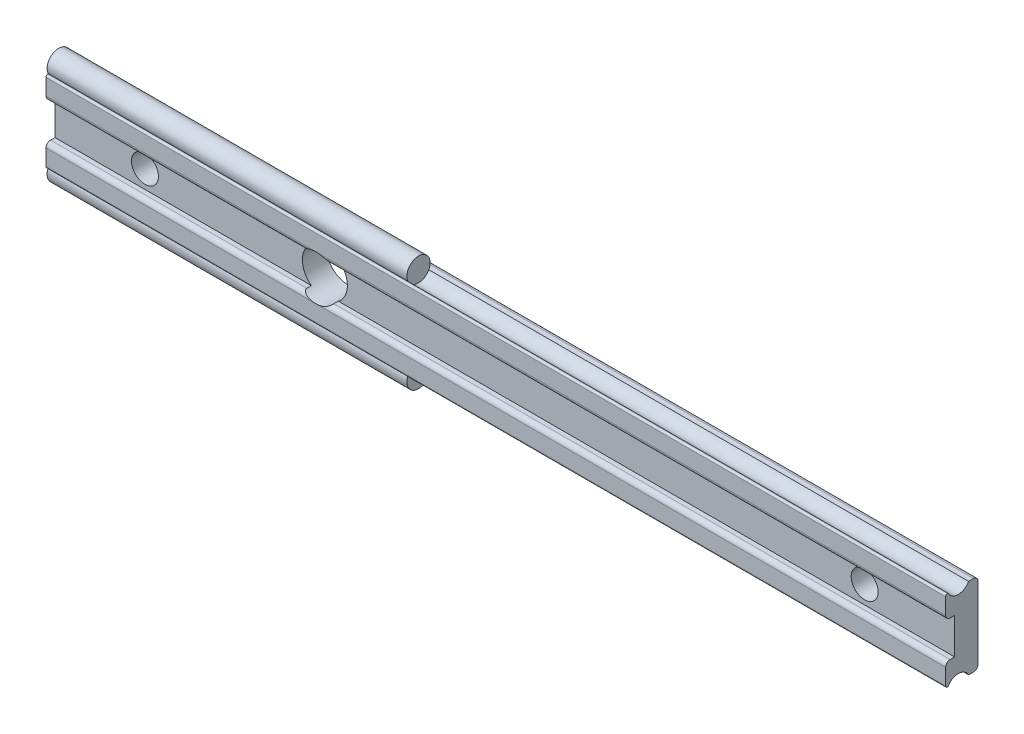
ISO-10303-21;
HEADER;
FILE_DESCRIPTION(('STEP AP214'),'2;1');
FILE_NAME('part.step','',(''),(''),'','','');
FILE_SCHEMA(('AUTOMOTIVE_DESIGN { 1 0 10303 214 1 1 1 1 }'));
ENDSEC;
DATA;
#1=APPLICATION_CONTEXT('core data for automotive mechanical design processes');
#2=APPLICATION_PROTOCOL_DEFINITION('international standard','automotive_design',2000,#1);
#3=PRODUCT_CONTEXT('',#1,'mechanical');
#4=PRODUCT('Part','Part','',(#3));
#5=PRODUCT_RELATED_PRODUCT_CATEGORY('part','',(#4));
#6=PRODUCT_DEFINITION_FORMATION('','',#4);
#7=PRODUCT_DEFINITION_CONTEXT('part definition',#1,'design');
#8=PRODUCT_DEFINITION('design','',#6,#7);
#9=PRODUCT_DEFINITION_SHAPE('','',#8);
#10=(LENGTH_UNIT() NAMED_UNIT(*) SI_UNIT(.MILLI.,.METRE.));
#11=(NAMED_UNIT(*) PLANE_ANGLE_UNIT() SI_UNIT($,.RADIAN.));
#12=(NAMED_UNIT(*) SI_UNIT($,.STERADIAN.) SOLID_ANGLE_UNIT());
#13=UNCERTAINTY_MEASURE_WITH_UNIT(LENGTH_MEASURE(1.E-05),#10,'distance_accuracy_value','');
#14=(GEOMETRIC_REPRESENTATION_CONTEXT(3) GLOBAL_UNCERTAINTY_ASSIGNED_CONTEXT((#13)) GLOBAL_UNIT_ASSIGNED_CONTEXT((#10,
#11,#12)) REPRESENTATION_CONTEXT('',''));
#15=CARTESIAN_POINT('',(0.,0.,0.));
#16=DIRECTION('',(0.,0.,1.));
#17=DIRECTION('',(1.,0.,0.));
#18=AXIS2_PLACEMENT_3D('',#15,#16,#17);
#19=CARTESIAN_POINT('',(-10.,-5.10000002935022,2.18999997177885));
#20=DIRECTION('',(1.,0.,0.));
#21=DIRECTION('',(0.,0.,-1.));
#22=AXIS2_PLACEMENT_3D('',#19,#20,#21);
#23=CYLINDRICAL_SURFACE('',#22,1.28999999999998);
#24=DIRECTION('',(1.,0.,0.));
#25=VECTOR('',#24,1.);
#26=CARTESIAN_POINT('',(-10.,-4.50000002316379,3.33197194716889));
#27=LINE('',#26,#25);
#28=CARTESIAN_POINT('',(30.,-4.50000002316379,3.33197194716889));
#29=VERTEX_POINT('',#28);
#30=CARTESIAN_POINT('',(90.,-4.50000002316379,3.33197194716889));
#31=VERTEX_POINT('',#30);
#32=EDGE_CURVE('E36',#29,#31,#27,.T.);
#33=ORIENTED_EDGE('',*,*,#32,.F.);
#34=CARTESIAN_POINT('',(30.,-5.10000002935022,2.18999997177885));
#35=DIRECTION('',(-1.,0.,0.));
#36=DIRECTION('',(0.,0.,1.));
#37=AXIS2_PLACEMENT_3D('',#34,#35,#36);
#38=CIRCLE('',#37,1.28999999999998);
#39=CARTESIAN_POINT('',(30.,-4.50000002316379,1.04802799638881));
#40=VERTEX_POINT('',#39);
#41=EDGE_CURVE('E31',#29,#40,#38,.T.);
#42=ORIENTED_EDGE('',*,*,#41,.T.);
#43=DIRECTION('',(1.,0.,0.));
#44=VECTOR('',#43,1.);
#45=CARTESIAN_POINT('',(-10.,-4.50000002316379,1.04802799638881));
#46=LINE('',#45,#44);
#47=CARTESIAN_POINT('',(90.,-4.50000002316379,1.04802799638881));
#48=VERTEX_POINT('',#47);
#49=EDGE_CURVE('E199',#40,#48,#46,.T.);
#50=ORIENTED_EDGE('',*,*,#49,.T.);
#51=CARTESIAN_POINT('',(90.,-5.10000002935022,2.18999997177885));
#52=DIRECTION('',(-1.,0.,0.));
#53=DIRECTION('',(0.,0.,1.));
#54=AXIS2_PLACEMENT_3D('',#51,#52,#53);
#55=CIRCLE('',#54,1.28999999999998);
#56=EDGE_CURVE('E343',#31,#48,#55,.T.);
#57=ORIENTED_EDGE('',*,*,#56,.F.);
#58=EDGE_LOOP('',(#33,#42,#50,#57));
#59=FACE_BOUND('',#58,.T.);
#60=ADVANCED_FACE('F14',(#59),#23,.F.);
#61=CARTESIAN_POINT('',(-10.,5.10000002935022,2.18999997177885));
#62=DIRECTION('',(1.,0.,0.));
#63=DIRECTION('',(0.,0.,-1.));
#64=AXIS2_PLACEMENT_3D('',#61,#62,#63);
#65=CYLINDRICAL_SURFACE('',#64,1.28999999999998);
#66=DIRECTION('',(1.,0.,0.));
#67=VECTOR('',#66,1.);
#68=CARTESIAN_POINT('',(-10.,4.50000002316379,1.04802799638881));
#69=LINE('',#68,#67);
#70=CARTESIAN_POINT('',(30.,4.50000002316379,1.04802799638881));
#71=VERTEX_POINT('',#70);
#72=CARTESIAN_POINT('',(90.,4.50000002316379,1.04802799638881));
#73=VERTEX_POINT('',#72);
#74=EDGE_CURVE('E434',#71,#73,#69,.T.);
#75=ORIENTED_EDGE('',*,*,#74,.F.);
#76=CARTESIAN_POINT('',(30.,5.10000002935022,2.18999997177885));
#77=DIRECTION('',(-1.,0.,0.));
#78=DIRECTION('',(0.,0.,1.));
#79=AXIS2_PLACEMENT_3D('',#76,#77,#78);
#80=CIRCLE('',#79,1.28999999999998);
#81=CARTESIAN_POINT('',(30.,4.50000002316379,3.33197194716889));
#82=VERTEX_POINT('',#81);
#83=EDGE_CURVE('E215',#71,#82,#80,.T.);
#84=ORIENTED_EDGE('',*,*,#83,.T.);
#85=DIRECTION('',(1.,0.,0.));
#86=VECTOR('',#85,1.);
#87=CARTESIAN_POINT('',(-10.,4.50000002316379,3.33197194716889));
#88=LINE('',#87,#86);
#89=CARTESIAN_POINT('',(90.,4.50000002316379,3.33197194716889));
#90=VERTEX_POINT('',#89);
#91=EDGE_CURVE('E431',#82,#90,#88,.T.);
#92=ORIENTED_EDGE('',*,*,#91,.T.);
#93=CARTESIAN_POINT('',(90.,5.10000002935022,2.18999997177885));
#94=DIRECTION('',(-1.,0.,0.));
#95=DIRECTION('',(0.,0.,-1.));
#96=AXIS2_PLACEMENT_3D('',#93,#94,#95);
#97=CIRCLE('',#96,1.28999999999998);
#98=EDGE_CURVE('E446',#73,#90,#97,.T.);
#99=ORIENTED_EDGE('',*,*,#98,.F.);
#100=EDGE_LOOP('',(#75,#84,#92,#99));
#101=FACE_BOUND('',#100,.T.);
#102=ADVANCED_FACE('F296',(#101),#65,.F.);
#103=CARTESIAN_POINT('',(-10.,-2.50000002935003,3.0999999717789));
#104=DIRECTION('',(1.,0.,0.));
#105=DIRECTION('',(0.,0.,-1.));
#106=AXIS2_PLACEMENT_3D('',#103,#104,#105);
#107=CYLINDRICAL_SURFACE('',#106,0.5);
#108=CARTESIAN_POINT('',(18.5000000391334,-2.00000002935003,3.0999999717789));
#109=CARTESIAN_POINT('',(18.4999623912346,-1.99996207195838,3.11987287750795));
#110=CARTESIAN_POINT('',(18.5015761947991,-2.00118249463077,3.13968780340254));
#111=CARTESIAN_POINT('',(18.5077735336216,-2.00581273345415,3.17838692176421));
#112=CARTESIAN_POINT('',(18.5123272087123,-2.00920053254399,3.19727844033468));
#113=CARTESIAN_POINT('',(18.524064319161,-2.01783620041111,3.23368112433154));
#114=CARTESIAN_POINT('',(18.5312395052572,-2.02307823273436,3.25119641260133));
#115=CARTESIAN_POINT('',(18.5478060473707,-2.03500322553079,3.28464478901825));
#116=CARTESIAN_POINT('',(18.5572029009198,-2.04168975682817,3.30057381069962));
#117=CARTESIAN_POINT('',(18.5821801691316,-2.05915126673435,3.33710629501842));
#118=CARTESIAN_POINT('',(18.5986909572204,-2.07045578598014,3.35681757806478));
#119=CARTESIAN_POINT('',(18.6343735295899,-2.09416519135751,3.39285662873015));
#120=CARTESIAN_POINT('',(18.6535504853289,-2.10657219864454,3.40917766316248));
#121=CARTESIAN_POINT('',(18.7057779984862,-2.13925431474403,3.44760067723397));
#122=CARTESIAN_POINT('',(18.7403171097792,-2.15983620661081,3.46739923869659));
#123=CARTESIAN_POINT('',(18.8124646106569,-2.20033841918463,3.50112098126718));
#124=CARTESIAN_POINT('',(18.850079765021,-2.22025713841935,3.51503077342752));
#125=CARTESIAN_POINT('',(18.9246423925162,-2.25725862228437,3.53761969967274));
#126=CARTESIAN_POINT('',(18.9614526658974,-2.27444229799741,3.54659655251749));
#127=CARTESIAN_POINT('',(19.0363776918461,-2.30718587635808,3.56167921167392));
#128=CARTESIAN_POINT('',(19.0744935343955,-2.32274437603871,3.56778255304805));
#129=CARTESIAN_POINT('',(19.1517657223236,-2.35206511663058,3.57786589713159));
#130=CARTESIAN_POINT('',(19.1909240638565,-2.36582356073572,3.5818414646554));
#131=CARTESIAN_POINT('',(19.2699963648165,-2.39140610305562,3.58824225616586));
#132=CARTESIAN_POINT('',(19.3099105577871,-2.40322959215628,3.59066699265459));
#133=CARTESIAN_POINT('',(19.4163047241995,-2.43187057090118,3.59567017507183));
#134=CARTESIAN_POINT('',(19.4832923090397,-2.44698126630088,3.59733638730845));
#135=CARTESIAN_POINT('',(19.6183198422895,-2.47164651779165,3.59934733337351));
#136=CARTESIAN_POINT('',(19.6863603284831,-2.48119813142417,3.59969136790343));
#137=CARTESIAN_POINT('',(19.8231051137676,-2.49468127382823,3.60001763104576));
#138=CARTESIAN_POINT('',(19.8918102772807,-2.49860408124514,3.59999929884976));
#139=CARTESIAN_POINT('',(20.0292885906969,-2.50077334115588,3.60000045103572));
#140=CARTESIAN_POINT('',(20.0980617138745,-2.49902150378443,3.60001992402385));
#141=CARTESIAN_POINT('',(20.2361894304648,-2.48979369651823,3.59991747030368));
#142=CARTESIAN_POINT('',(20.3055387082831,-2.48223803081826,3.59979356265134));
#143=CARTESIAN_POINT('',(20.4434132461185,-2.46135084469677,3.59861400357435));
#144=CARTESIAN_POINT('',(20.5119378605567,-2.44801506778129,3.5975576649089));
#145=CARTESIAN_POINT('',(20.647193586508,-2.41577094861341,3.59312171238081));
#146=CARTESIAN_POINT('',(20.7139325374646,-2.396893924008,3.5897550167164));
#147=CARTESIAN_POINT('',(20.8452354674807,-2.35378973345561,3.57866700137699));
#148=CARTESIAN_POINT('',(20.9098033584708,-2.32957285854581,3.57095401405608));
#149=CARTESIAN_POINT('',(21.0068972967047,-2.28856748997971,3.5533641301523));
#150=CARTESIAN_POINT('',(21.0405930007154,-2.27343563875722,3.54608306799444));
#151=CARTESIAN_POINT('',(21.1067254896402,-2.24198497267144,3.52866413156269));
#152=CARTESIAN_POINT('',(21.1391613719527,-2.2256653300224,3.51852425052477));
#153=CARTESIAN_POINT('',(21.2024883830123,-2.19210294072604,3.49449855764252));
#154=CARTESIAN_POINT('',(21.233366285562,-2.17485425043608,3.48058554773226));
#155=CARTESIAN_POINT('',(21.2924927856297,-2.14023972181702,3.44804575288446));
#156=CARTESIAN_POINT('',(21.3207460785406,-2.12287415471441,3.42942761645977));
#157=CARTESIAN_POINT('',(21.3636912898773,-2.09540988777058,3.39428778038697));
#158=CARTESIAN_POINT('',(21.3795669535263,-2.08497392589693,3.37948471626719));
#159=CARTESIAN_POINT('',(21.4092206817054,-2.0650457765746,3.3473296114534));
#160=CARTESIAN_POINT('',(21.4230004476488,-2.05555282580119,3.32997966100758));
#161=CARTESIAN_POINT('',(21.4458455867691,-2.03953296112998,3.29562678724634));
#162=CARTESIAN_POINT('',(21.4553118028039,-2.03277439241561,3.27900168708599));
#163=CARTESIAN_POINT('',(21.4718168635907,-2.02085580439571,3.24408352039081));
#164=CARTESIAN_POINT('',(21.4788617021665,-2.01569184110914,3.22579471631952));
#165=CARTESIAN_POINT('',(21.4895121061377,-2.00783357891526,3.18984795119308));
#166=CARTESIAN_POINT('',(21.4933960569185,-2.00494048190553,3.17231727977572));
#167=CARTESIAN_POINT('',(21.4986638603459,-2.00100227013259,3.13654134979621));
#168=CARTESIAN_POINT('',(21.5000272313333,-1.9999722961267,3.11829145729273));
#169=CARTESIAN_POINT('',(21.4999999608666,-2.00000002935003,3.0999999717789));
#170=B_SPLINE_CURVE_WITH_KNOTS('',3,(#108,#109,#110,#111,#112,#113,#114,#115,#116,#117,#118,
#119,#120,#121,#122,#123,#124,#125,#126,#127,#128,#129,#130,#131,#132,#133,#134,#135,#136,#137,
#138,#139,#140,#141,#142,#143,#144,#145,#146,#147,#148,#149,#150,#151,#152,#153,#154,#155,#156,
#157,#158,#159,#160,#161,#162,#163,#164,#165,#166,#167,#168,#169),.UNSPECIFIED.,.F.,.F.,(4,2,2,
2,2,2,2,2,2,2,2,2,2,2,2,2,2,2,2,2,2,2,2,2,2,2,2,2,2,2,4),(0.,0.0594240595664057,
0.11825384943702,0.176900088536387,0.235692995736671,0.319483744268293,0.403439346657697,
0.537132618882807,0.671128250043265,0.795755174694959,0.920488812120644,1.04548144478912,
1.17051334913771,1.37630111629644,1.58219770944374,1.78841297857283,1.99456610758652,
2.20360179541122,2.41279168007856,2.62082132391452,2.82845350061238,2.94128618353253,
3.05419826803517,3.16794695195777,3.28148805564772,3.35355275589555,3.42555863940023,
3.48619419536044,3.54667855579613,3.6009670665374,3.65569480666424),.UNSPECIFIED.);
#171=CARTESIAN_POINT('',(18.5000000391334,-2.00000002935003,3.0999999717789));
#172=VERTEX_POINT('',#171);
#173=CARTESIAN_POINT('',(20.,-2.50000002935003,3.5999999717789));
#174=VERTEX_POINT('',#173);
#175=EDGE_CURVE('E258',#172,#174,#170,.T.);
#176=ORIENTED_EDGE('',*,*,#175,.F.);
#177=DIRECTION('',(1.,0.,0.));
#178=VECTOR('',#177,1.);
#179=CARTESIAN_POINT('',(-10.,-2.00000002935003,3.0999999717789));
#180=LINE('',#179,#178);
#181=CARTESIAN_POINT('',(-10.,-2.00000002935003,3.0999999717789));
#182=VERTEX_POINT('',#181);
#183=EDGE_CURVE('E404',#182,#172,#180,.T.);
#184=ORIENTED_EDGE('',*,*,#183,.F.);
#185=CARTESIAN_POINT('',(-10.,-2.50000002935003,3.0999999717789));
#186=DIRECTION('',(1.,0.,0.));
#187=DIRECTION('',(0.,0.,1.));
#188=AXIS2_PLACEMENT_3D('',#185,#186,#187);
#189=CIRCLE('',#188,0.5);
#190=CARTESIAN_POINT('',(-10.,-2.50000002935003,3.5999999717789));
#191=VERTEX_POINT('',#190);
#192=EDGE_CURVE('E381',#182,#191,#189,.T.);
#193=ORIENTED_EDGE('',*,*,#192,.T.);
#194=DIRECTION('',(1.,0.,0.));
#195=VECTOR('',#194,1.);
#196=CARTESIAN_POINT('',(-10.,-2.50000002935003,3.5999999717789));
#197=LINE('',#196,#195);
#198=EDGE_CURVE('E400',#191,#174,#197,.T.);
#199=ORIENTED_EDGE('',*,*,#198,.T.);
#200=EDGE_LOOP('',(#176,#184,#193,#199));
#201=FACE_BOUND('',#200,.T.);
#202=ADVANCED_FACE('F271',(#201),#107,.T.);
#203=CARTESIAN_POINT('',(-10.,-2.00000002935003,3.0999999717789));
#204=DIRECTION('',(0.,1.,0.));
#205=DIRECTION('',(1.,0.,0.));
#206=AXIS2_PLACEMENT_3D('',#203,#204,#205);
#207=PLANE('',#206);
#208=DIRECTION('',(0.,0.,-1.));
#209=VECTOR('',#208,1.);
#210=CARTESIAN_POINT('',(21.4999999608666,-2.00000002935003,3.5999999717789));
#211=LINE('',#210,#209);
#212=CARTESIAN_POINT('',(21.4999999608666,-2.00000002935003,3.0999999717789));
#213=VERTEX_POINT('',#212);
#214=CARTESIAN_POINT('',(21.4999999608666,-2.00000002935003,2.59999996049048));
#215=VERTEX_POINT('',#214);
#216=EDGE_CURVE('E259',#213,#215,#211,.T.);
#217=ORIENTED_EDGE('',*,*,#216,.F.);
#218=CARTESIAN_POINT('',(90.,-2.00000002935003,3.0999999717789));
#219=VERTEX_POINT('',#218);
#220=EDGE_CURVE('E407',#213,#219,#180,.T.);
#221=ORIENTED_EDGE('',*,*,#220,.T.);
#222=DIRECTION('',(0.,0.,1.));
#223=VECTOR('',#222,1.);
#224=CARTESIAN_POINT('',(90.,-2.00000002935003,3.0999999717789));
#225=LINE('',#224,#223);
#226=CARTESIAN_POINT('',(90.,-2.00000002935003,2.59999996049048));
#227=VERTEX_POINT('',#226);
#228=EDGE_CURVE('E338',#227,#219,#225,.T.);
#229=ORIENTED_EDGE('',*,*,#228,.F.);
#230=DIRECTION('',(1.,0.,0.));
#231=VECTOR('',#230,1.);
#232=CARTESIAN_POINT('',(-10.,-2.00000002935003,2.59999996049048));
#233=LINE('',#232,#231);
#234=EDGE_CURVE('E411',#215,#227,#233,.T.);
#235=ORIENTED_EDGE('',*,*,#234,.F.);
#236=EDGE_LOOP('',(#217,#221,#229,#235));
#237=FACE_BOUND('',#236,.T.);
#238=ADVANCED_FACE('F277',(#237),#207,.T.);
#239=CARTESIAN_POINT('',(-10.,-2.00000002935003,2.59999996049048));
#240=DIRECTION('',(0.,0.,1.));
#241=DIRECTION('',(1.,0.,0.));
#242=AXIS2_PLACEMENT_3D('',#239,#240,#241);
#243=PLANE('',#242);
#244=CARTESIAN_POINT('',(0.,0.,2.59999996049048));
#245=DIRECTION('',(0.,0.,1.));
#246=DIRECTION('',(1.,0.,0.));
#247=AXIS2_PLACEMENT_3D('',#244,#245,#246);
#248=CIRCLE('',#247,1.5);
#249=CARTESIAN_POINT('',(1.5,0.,2.59999996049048));
#250=VERTEX_POINT('',#249);
#251=EDGE_CURVE('E716',#250,#250,#248,.T.);
#252=ORIENTED_EDGE('',*,*,#251,.F.);
#253=EDGE_LOOP('',(#252));
#254=FACE_BOUND('',#253,.T.);
#255=CARTESIAN_POINT('',(20.,0.,2.59999996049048));
#256=DIRECTION('',(0.,0.,1.));
#257=DIRECTION('',(1.,0.,0.));
#258=AXIS2_PLACEMENT_3D('',#255,#256,#257);
#259=CIRCLE('',#258,2.5);
#260=CARTESIAN_POINT('',(18.5000000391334,2.00000002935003,2.59999996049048));
#261=VERTEX_POINT('',#260);
#262=CARTESIAN_POINT('',(18.5000000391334,-2.00000002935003,2.59999996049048));
#263=VERTEX_POINT('',#262);
#264=EDGE_CURVE('E485',#261,#263,#259,.T.);
#265=ORIENTED_EDGE('',*,*,#264,.F.);
#266=DIRECTION('',(1.,0.,0.));
#267=VECTOR('',#266,1.);
#268=CARTESIAN_POINT('',(-10.,2.00000002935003,2.59999996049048));
#269=LINE('',#268,#267);
#270=CARTESIAN_POINT('',(-10.,2.00000002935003,2.59999996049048));
#271=VERTEX_POINT('',#270);
#272=EDGE_CURVE('E412',#271,#261,#269,.T.);
#273=ORIENTED_EDGE('',*,*,#272,.F.);
#274=DIRECTION('',(0.,-1.,0.));
#275=VECTOR('',#274,1.);
#276=CARTESIAN_POINT('',(-10.,-2.00000002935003,2.59999996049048));
#277=LINE('',#276,#275);
#278=CARTESIAN_POINT('',(-10.,-2.00000002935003,2.59999996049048));
#279=VERTEX_POINT('',#278);
#280=EDGE_CURVE('E375',#271,#279,#277,.T.);
#281=ORIENTED_EDGE('',*,*,#280,.T.);
#282=EDGE_CURVE('E408',#279,#263,#233,.T.);
#283=ORIENTED_EDGE('',*,*,#282,.T.);
#284=EDGE_LOOP('',(#265,#273,#281,#283));
#285=FACE_BOUND('',#284,.T.);
#286=ADVANCED_FACE('F281',(#254,#285),#243,.T.);
#287=CARTESIAN_POINT('',(-10.,2.00000002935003,3.0999999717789));
#288=DIRECTION('',(0.,-1.,0.));
#289=DIRECTION('',(-1.,0.,0.));
#290=AXIS2_PLACEMENT_3D('',#287,#288,#289);
#291=PLANE('',#290);
#292=DIRECTION('',(0.,0.,-1.));
#293=VECTOR('',#292,1.);
#294=CARTESIAN_POINT('',(18.5000000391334,2.00000002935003,3.5999999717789));
#295=LINE('',#294,#293);
#296=CARTESIAN_POINT('',(18.500000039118,2.00000002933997,3.09999997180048));
#297=VERTEX_POINT('',#296);
#298=EDGE_CURVE('E489',#297,#261,#295,.T.);
#299=ORIENTED_EDGE('',*,*,#298,.F.);
#300=DIRECTION('',(1.,0.,0.));
#301=VECTOR('',#300,1.);
#302=CARTESIAN_POINT('',(-10.,2.00000002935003,3.0999999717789));
#303=LINE('',#302,#301);
#304=CARTESIAN_POINT('',(-10.,2.00000002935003,3.0999999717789));
#305=VERTEX_POINT('',#304);
#306=EDGE_CURVE('E416',#305,#297,#303,.T.);
#307=ORIENTED_EDGE('',*,*,#306,.F.);
#308=DIRECTION('',(0.,0.,-1.));
#309=VECTOR('',#308,1.);
#310=CARTESIAN_POINT('',(-10.,2.00000002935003,3.0999999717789));
#311=LINE('',#310,#309);
#312=EDGE_CURVE('E372',#305,#271,#311,.T.);
#313=ORIENTED_EDGE('',*,*,#312,.T.);
#314=ORIENTED_EDGE('',*,*,#272,.T.);
#315=EDGE_LOOP('',(#299,#307,#313,#314));
#316=FACE_BOUND('',#315,.T.);
#317=ADVANCED_FACE('F284',(#316),#291,.T.);
#318=CARTESIAN_POINT('',(-10.,2.50000002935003,3.0999999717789));
#319=DIRECTION('',(1.,0.,0.));
#320=DIRECTION('',(0.,0.,-1.));
#321=AXIS2_PLACEMENT_3D('',#318,#319,#320);
#322=CYLINDRICAL_SURFACE('',#321,0.5);
#323=CARTESIAN_POINT('',(20.,2.50000002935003,2.5999999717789));
#324=CARTESIAN_POINT('',(20.069780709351,2.49999961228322,2.59999684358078));
#325=CARTESIAN_POINT('',(20.1395723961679,2.49707593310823,2.59997347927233));
#326=CARTESIAN_POINT('',(20.2787151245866,2.48539690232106,2.6001800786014));
#327=CARTESIAN_POINT('',(20.348065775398,2.47663695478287,2.60041024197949));
#328=CARTESIAN_POINT('',(20.4859229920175,2.45331869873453,2.60204582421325));
#329=CARTESIAN_POINT('',(20.5544276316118,2.43874903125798,2.60345355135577));
#330=CARTESIAN_POINT('',(20.6898082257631,2.40396478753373,2.60899333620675));
#331=CARTESIAN_POINT('',(20.756685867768,2.38375635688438,2.61312243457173));
#332=CARTESIAN_POINT('',(20.8878611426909,2.33805107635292,2.62635222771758));
#333=CARTESIAN_POINT('',(20.9521694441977,2.31257958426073,2.6354294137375));
#334=CARTESIAN_POINT('',(21.0456684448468,2.2710659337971,2.65523231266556));
#335=CARTESIAN_POINT('',(21.0762719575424,2.25671479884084,2.66283922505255));
#336=CARTESIAN_POINT('',(21.1362469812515,2.22711837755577,2.68067268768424));
#337=CARTESIAN_POINT('',(21.1656196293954,2.21187394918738,2.6908967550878));
#338=CARTESIAN_POINT('',(21.2198533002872,2.18238701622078,2.71343738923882));
#339=CARTESIAN_POINT('',(21.2448711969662,2.16819760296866,2.72544077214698));
#340=CARTESIAN_POINT('',(21.2931470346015,2.13975590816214,2.75270629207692));
#341=CARTESIAN_POINT('',(21.3164016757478,2.12550355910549,2.76797434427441));
#342=CARTESIAN_POINT('',(21.3606798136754,2.09743792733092,2.80259720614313));
#343=CARTESIAN_POINT('',(21.3816675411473,2.08363357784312,2.82200620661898));
#344=CARTESIAN_POINT('',(21.4198250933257,2.05782015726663,2.86525768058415));
#345=CARTESIAN_POINT('',(21.4370109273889,2.04580363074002,2.88908075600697));
#346=CARTESIAN_POINT('',(21.4601638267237,2.02929472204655,2.93054582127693));
#347=CARTESIAN_POINT('',(21.4678583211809,2.02372383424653,2.94679690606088));
#348=CARTESIAN_POINT('',(21.4809806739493,2.01414052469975,2.98063213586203));
#349=CARTESIAN_POINT('',(21.4864099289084,2.01012714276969,2.9982154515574));
#350=CARTESIAN_POINT('',(21.4946932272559,2.00397599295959,3.03443077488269));
#351=CARTESIAN_POINT('',(21.4975302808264,2.00185060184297,3.05306886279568));
#352=CARTESIAN_POINT('',(21.5003573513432,1.99973280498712,3.09067994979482));
#353=CARTESIAN_POINT('',(21.5003484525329,1.99973958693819,3.10965281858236));
#354=CARTESIAN_POINT('',(21.497624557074,2.00177987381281,3.14547864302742));
#355=CARTESIAN_POINT('',(21.4951642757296,2.00362260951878,3.16236308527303));
#356=CARTESIAN_POINT('',(21.4880645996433,2.00890097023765,3.19540315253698));
#357=CARTESIAN_POINT('',(21.4834248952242,2.01233682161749,3.21155867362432));
#358=CARTESIAN_POINT('',(21.4720098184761,2.02070243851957,3.24336707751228));
#359=CARTESIAN_POINT('',(21.465164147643,2.02568113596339,3.25898145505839));
#360=CARTESIAN_POINT('',(21.4497114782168,2.03676887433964,3.28886889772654));
#361=CARTESIAN_POINT('',(21.4411036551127,2.04287844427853,3.30314133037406));
#362=CARTESIAN_POINT('',(21.4169435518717,2.05975585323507,3.33823463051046));
#363=CARTESIAN_POINT('',(21.4002789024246,2.07115448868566,3.35798793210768));
#364=CARTESIAN_POINT('',(21.3642668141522,2.09505326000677,3.39409026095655));
#365=CARTESIAN_POINT('',(21.3449122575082,2.10755628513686,3.41042995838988));
#366=CARTESIAN_POINT('',(21.2922096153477,2.14047625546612,3.44887366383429));
#367=CARTESIAN_POINT('',(21.2573666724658,2.16119156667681,3.46865418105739));
#368=CARTESIAN_POINT('',(21.1846096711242,2.20192103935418,3.50230255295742));
#369=CARTESIAN_POINT('',(21.1466891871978,2.2219336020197,3.51615763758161));
#370=CARTESIAN_POINT('',(21.0714819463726,2.25910706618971,3.53864276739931));
#371=CARTESIAN_POINT('',(21.0343299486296,2.27636940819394,3.547565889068));
#372=CARTESIAN_POINT('',(20.9587172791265,2.30923445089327,3.56253063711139));
#373=CARTESIAN_POINT('',(20.9202555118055,2.32483571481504,3.56856978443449));
#374=CARTESIAN_POINT('',(20.8422841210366,2.35420842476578,3.5785242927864));
#375=CARTESIAN_POINT('',(20.8027723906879,2.36797579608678,3.58243498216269));
#376=CARTESIAN_POINT('',(20.7229920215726,2.39354107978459,3.58871158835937));
#377=CARTESIAN_POINT('',(20.6827231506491,2.40533837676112,3.59107702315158));
#378=CARTESIAN_POINT('',(20.5757687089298,2.43376380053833,3.5959198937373));
#379=CARTESIAN_POINT('',(20.5085845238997,2.44868671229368,3.59751014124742));
#380=CARTESIAN_POINT('',(20.3731800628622,2.47294830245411,3.59941453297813));
#381=CARTESIAN_POINT('',(20.3049592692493,2.48228409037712,3.59972801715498));
#382=CARTESIAN_POINT('',(20.1679315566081,2.49530310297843,3.60002072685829));
#383=CARTESIAN_POINT('',(20.0991242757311,2.49898253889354,3.59999972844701));
#384=CARTESIAN_POINT('',(19.9614619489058,2.50065037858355,3.60000014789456));
#385=CARTESIAN_POINT('',(19.8926069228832,2.49864045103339,3.6000215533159));
#386=CARTESIAN_POINT('',(19.7545108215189,2.48889147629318,3.59990066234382));
#387=CARTESIAN_POINT('',(19.6852743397,2.48108715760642,3.59975649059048));
#388=CARTESIAN_POINT('',(19.5476490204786,2.45972182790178,3.59849012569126));
#389=CARTESIAN_POINT('',(19.4792608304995,2.44615666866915,3.59736722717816));
#390=CARTESIAN_POINT('',(19.3439854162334,2.41339584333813,3.59272083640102));
#391=CARTESIAN_POINT('',(19.2770966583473,2.3942062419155,3.58919992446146));
#392=CARTESIAN_POINT('',(19.1455781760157,2.3504797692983,3.57765819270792));
#393=CARTESIAN_POINT('',(19.080944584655,2.32595263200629,3.56964552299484));
#394=CARTESIAN_POINT('',(18.961423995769,2.27488794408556,3.5472404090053));
#395=CARTESIAN_POINT('',(18.9062176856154,2.24881546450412,3.53358757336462));
#396=CARTESIAN_POINT('',(18.8269591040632,2.20790883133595,3.50613518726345));
#397=CARTESIAN_POINT('',(18.8012028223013,2.19401762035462,3.49586302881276));
#398=CARTESIAN_POINT('',(18.7511989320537,2.16594371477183,3.47247956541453));
#399=CARTESIAN_POINT('',(18.7269491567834,2.15176147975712,3.45937246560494));
#400=CARTESIAN_POINT('',(18.6853213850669,2.1265194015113,3.43282676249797));
#401=CARTESIAN_POINT('',(18.667563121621,2.11542361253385,3.42002403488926));
#402=CARTESIAN_POINT('',(18.6336986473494,2.09371073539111,3.39196563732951));
#403=CARTESIAN_POINT('',(18.6175942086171,2.08309416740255,3.37670738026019));
#404=CARTESIAN_POINT('',(18.5874473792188,2.06277214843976,3.34334601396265));
#405=CARTESIAN_POINT('',(18.5734283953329,2.05307742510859,3.32521473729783));
#406=CARTESIAN_POINT('',(18.5484215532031,2.03547394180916,3.28619898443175));
#407=CARTESIAN_POINT('',(18.5374266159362,2.02756101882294,3.26532111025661));
#408=CARTESIAN_POINT('',(18.5218205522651,2.0161973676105,3.22732618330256));
#409=CARTESIAN_POINT('',(18.5162844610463,2.01211769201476,3.21077709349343));
#410=CARTESIAN_POINT('',(18.5075194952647,2.00562509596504,3.17676126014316));
#411=CARTESIAN_POINT('',(18.5042891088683,2.00321108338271,3.15929512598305));
#412=CARTESIAN_POINT('',(18.5003337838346,2.00025191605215,3.12385463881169));
#413=CARTESIAN_POINT('',(18.4996181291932,1.99971368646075,3.10587864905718));
#414=CARTESIAN_POINT('',(18.5007681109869,2.00057596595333,3.07005672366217));
#415=CARTESIAN_POINT('',(18.5026338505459,2.00197655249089,3.05221079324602));
#416=CARTESIAN_POINT('',(18.5086526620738,2.00646351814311,3.01813721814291));
#417=CARTESIAN_POINT('',(18.5126783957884,2.00945597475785,3.00187403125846));
#418=CARTESIAN_POINT('',(18.5227062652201,2.01683957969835,2.97031120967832));
#419=CARTESIAN_POINT('',(18.5287090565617,2.021231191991,2.95501189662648));
#420=CARTESIAN_POINT('',(18.5449788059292,2.03298963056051,2.92012689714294));
#421=CARTESIAN_POINT('',(18.5560014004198,2.04085558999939,2.90106185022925));
#422=CARTESIAN_POINT('',(18.5805769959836,2.05802434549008,2.86536857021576));
#423=CARTESIAN_POINT('',(18.5941350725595,2.06733001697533,2.84874534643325));
#424=CARTESIAN_POINT('',(18.6299444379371,2.09131494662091,2.81070475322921));
#425=CARTESIAN_POINT('',(18.6533074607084,2.10648162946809,2.79064977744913));
#426=CARTESIAN_POINT('',(18.7028534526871,2.13735094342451,2.75497203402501));
#427=CARTESIAN_POINT('',(18.7290417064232,2.15305454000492,2.73935777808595));
#428=CARTESIAN_POINT('',(18.7795657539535,2.18203276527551,2.71371523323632));
#429=CARTESIAN_POINT('',(18.8036475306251,2.19533963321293,2.70321093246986));
#430=CARTESIAN_POINT('',(18.8529228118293,2.22148472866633,2.68444296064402));
#431=CARTESIAN_POINT('',(18.8781171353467,2.23432259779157,2.6761809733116));
#432=CARTESIAN_POINT('',(18.9550874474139,2.271873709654,2.65412013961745));
#433=CARTESIAN_POINT('',(19.0081550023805,2.29556896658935,2.64309056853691));
#434=CARTESIAN_POINT('',(19.1139956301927,2.33840201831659,2.62630514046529));
#435=CARTESIAN_POINT('',(19.166676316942,2.35769592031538,2.62033605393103));
#436=CARTESIAN_POINT('',(19.2734821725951,2.39276663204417,2.61129875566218));
#437=CARTESIAN_POINT('',(19.3276086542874,2.40854011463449,2.60823327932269));
#438=CARTESIAN_POINT('',(19.4368305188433,2.43639429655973,2.60386249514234));
#439=CARTESIAN_POINT('',(19.4919253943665,2.44847687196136,2.60255629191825));
#440=CARTESIAN_POINT('',(19.602787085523,2.4688856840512,2.60086397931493));
#441=CARTESIAN_POINT('',(19.6585535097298,2.47721400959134,2.60047735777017));
#442=CARTESIAN_POINT('',(19.7619103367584,2.48909375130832,2.60008975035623));
#443=CARTESIAN_POINT('',(19.8094395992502,2.4931827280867,2.60003861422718));
#444=CARTESIAN_POINT('',(19.9046442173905,2.49863577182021,2.59999479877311));
#445=CARTESIAN_POINT('',(19.9523195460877,2.50000031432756,2.60000210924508));
#446=CARTESIAN_POINT('',(20.,2.50000002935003,2.5999999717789));
#447=B_SPLINE_CURVE_WITH_KNOTS('',3,(#323,#324,#325,#326,#327,#328,#329,#330,#331,#332,#333,
#334,#335,#336,#337,#338,#339,#340,#341,#342,#343,#344,#345,#346,#347,#348,#349,#350,#351,#352,
#353,#354,#355,#356,#357,#358,#359,#360,#361,#362,#363,#364,#365,#366,#367,#368,#369,#370,#371,
#372,#373,#374,#375,#376,#377,#378,#379,#380,#381,#382,#383,#384,#385,#386,#387,#388,#389,#390,
#391,#392,#393,#394,#395,#396,#397,#398,#399,#400,#401,#402,#403,#404,#405,#406,#407,#408,#409,
#410,#411,#412,#413,#414,#415,#416,#417,#418,#419,#420,#421,#422,#423,#424,#425,#426,#427,#428,
#429,#430,#431,#432,#433,#434,#435,#436,#437,#438,#439,#440,#441,#442,#443,#444,#445,#446),
.UNSPECIFIED.,.T.,.F.,(4,2,2,2,2,2,2,2,2,2,2,2,2,2,2,2,2,2,2,2,2,2,2,2,2,2,2,2,2,2,2,2,2,2,2,2,
2,2,2,2,2,2,2,2,2,2,2,2,2,2,2,2,2,2,2,2,2,2,2,2,2,4),(0.,0.209299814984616,0.418764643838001,
0.628641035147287,0.838289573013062,1.04695062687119,1.15079109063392,1.25453340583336,
1.34785907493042,1.44135529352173,1.53615966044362,1.63055687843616,1.68681937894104,
1.74304713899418,1.79964083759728,1.85621297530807,1.90746182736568,1.95871796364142,
2.0118030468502,2.06491302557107,2.14916554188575,2.2336454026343,2.36819630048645,
2.50303572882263,2.62863165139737,2.75433534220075,2.88031383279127,3.00633160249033,
3.21256676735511,3.41890853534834,3.62538845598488,3.83180782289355,4.0405883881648,
4.24951954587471,4.45822624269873,4.66655547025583,4.85349204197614,4.94640888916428,
5.03918884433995,5.11267285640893,5.18623480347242,5.2605685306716,5.33472673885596,
5.38826947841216,5.44177707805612,5.49548201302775,5.54918909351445,5.60003092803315,
5.65088963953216,5.72065337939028,5.79055829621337,5.89295139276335,5.99553944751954,
6.08376383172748,6.17205428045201,6.34898886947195,6.51803376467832,6.68723775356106,
6.85635559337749,7.02537922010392,7.16841663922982,7.31142908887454),.UNSPECIFIED.);
#448=CARTESIAN_POINT('',(21.499999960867,2.00000002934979,3.09999997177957));
#449=VERTEX_POINT('',#448);
#450=CARTESIAN_POINT('',(20.,2.50000002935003,3.5999999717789));
#451=VERTEX_POINT('',#450);
#452=EDGE_CURVE('E231',#449,#451,#447,.T.);
#453=ORIENTED_EDGE('',*,*,#452,.F.);
#454=CARTESIAN_POINT('',(90.,2.00000002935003,3.0999999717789));
#455=VERTEX_POINT('',#454);
#456=EDGE_CURVE('E419',#449,#455,#303,.T.);
#457=ORIENTED_EDGE('',*,*,#456,.T.);
#458=CARTESIAN_POINT('',(90.,2.50000002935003,3.0999999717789));
#459=DIRECTION('',(1.,0.,0.));
#460=DIRECTION('',(0.,0.,-1.));
#461=AXIS2_PLACEMENT_3D('',#458,#459,#460);
#462=CIRCLE('',#461,0.5);
#463=CARTESIAN_POINT('',(90.,2.50000002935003,3.5999999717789));
#464=VERTEX_POINT('',#463);
#465=EDGE_CURVE('E460',#464,#455,#462,.T.);
#466=ORIENTED_EDGE('',*,*,#465,.F.);
#467=DIRECTION('',(1.,0.,0.));
#468=VECTOR('',#467,1.);
#469=CARTESIAN_POINT('',(-10.,2.50000002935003,3.5999999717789));
#470=LINE('',#469,#468);
#471=EDGE_CURVE('E423',#451,#464,#470,.T.);
#472=ORIENTED_EDGE('',*,*,#471,.F.);
#473=EDGE_LOOP('',(#453,#457,#466,#472));
#474=FACE_BOUND('',#473,.T.);
#475=ADVANCED_FACE('F291',(#474),#322,.T.);
#476=CARTESIAN_POINT('',(-10.,4.00000002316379,0.5));
#477=DIRECTION('',(1.,0.,0.));
#478=DIRECTION('',(0.,0.,-1.));
#479=AXIS2_PLACEMENT_3D('',#476,#477,#478);
#480=CYLINDRICAL_SURFACE('',#479,0.5);
#481=CARTESIAN_POINT('',(90.,4.00000002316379,0.5));
#482=DIRECTION('',(1.,0.,0.));
#483=DIRECTION('',(0.,0.,-1.));
#484=AXIS2_PLACEMENT_3D('',#481,#482,#483);
#485=CIRCLE('',#484,0.5);
#486=CARTESIAN_POINT('',(90.,4.00000002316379,0.));
#487=VERTEX_POINT('',#486);
#488=CARTESIAN_POINT('',(90.,4.50000002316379,0.5));
#489=VERTEX_POINT('',#488);
#490=EDGE_CURVE('E261',#487,#489,#485,.T.);
#491=ORIENTED_EDGE('',*,*,#490,.F.);
#492=DIRECTION('',(1.,0.,0.));
#493=VECTOR('',#492,1.);
#494=CARTESIAN_POINT('',(-10.,4.00000002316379,0.));
#495=LINE('',#494,#493);
#496=CARTESIAN_POINT('',(-10.,4.00000002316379,0.));
#497=VERTEX_POINT('',#496);
#498=EDGE_CURVE('E9',#497,#487,#495,.T.);
#499=ORIENTED_EDGE('',*,*,#498,.F.);
#500=CARTESIAN_POINT('',(-10.,4.00000002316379,0.5));
#501=DIRECTION('',(1.,0.,0.));
#502=DIRECTION('',(0.,0.,-1.));
#503=AXIS2_PLACEMENT_3D('',#500,#501,#502);
#504=CIRCLE('',#503,0.5);
#505=CARTESIAN_POINT('',(-10.,4.50000002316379,0.5));
#506=VERTEX_POINT('',#505);
#507=EDGE_CURVE('E355',#497,#506,#504,.T.);
#508=ORIENTED_EDGE('',*,*,#507,.T.);
#509=DIRECTION('',(1.,0.,0.));
#510=VECTOR('',#509,1.);
#511=CARTESIAN_POINT('',(-10.,4.50000002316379,0.5));
#512=LINE('',#511,#510);
#513=EDGE_CURVE('E393',#506,#489,#512,.T.);
#514=ORIENTED_EDGE('',*,*,#513,.T.);
#515=EDGE_LOOP('',(#491,#499,#508,#514));
#516=FACE_BOUND('',#515,.T.);
#517=ADVANCED_FACE('F16',(#516),#480,.T.);
#518=CARTESIAN_POINT('',(-10.,-4.00000002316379,0.));
#519=DIRECTION('',(0.,0.,-1.));
#520=DIRECTION('',(-1.,0.,0.));
#521=AXIS2_PLACEMENT_3D('',#518,#519,#520);
#522=PLANE('',#521);
#523=CARTESIAN_POINT('',(0.,0.,0.));
#524=DIRECTION('',(0.,0.,-1.));
#525=DIRECTION('',(-1.,0.,0.));
#526=AXIS2_PLACEMENT_3D('',#523,#524,#525);
#527=CIRCLE('',#526,1.5);
#528=CARTESIAN_POINT('',(-1.5,0.,0.));
#529=VERTEX_POINT('',#528);
#530=EDGE_CURVE('E18',#529,#529,#527,.T.);
#531=ORIENTED_EDGE('',*,*,#530,.F.);
#532=EDGE_LOOP('',(#531));
#533=FACE_BOUND('',#532,.T.);
#534=CARTESIAN_POINT('',(80.,0.,0.));
#535=DIRECTION('',(0.,0.,-1.));
#536=DIRECTION('',(-1.,0.,0.));
#537=AXIS2_PLACEMENT_3D('',#534,#535,#536);
#538=CIRCLE('',#537,1.5);
#539=CARTESIAN_POINT('',(78.5,0.,0.));
#540=VERTEX_POINT('',#539);
#541=EDGE_CURVE('E212',#540,#540,#538,.T.);
#542=ORIENTED_EDGE('',*,*,#541,.F.);
#543=EDGE_LOOP('',(#542));
#544=FACE_BOUND('',#543,.T.);
#545=CARTESIAN_POINT('',(20.,0.,0.));
#546=DIRECTION('',(0.,0.,-1.));
#547=DIRECTION('',(-1.,0.,0.));
#548=AXIS2_PLACEMENT_3D('',#545,#546,#547);
#549=CIRCLE('',#548,2.5);
#550=CARTESIAN_POINT('',(17.5,0.,0.));
#551=VERTEX_POINT('',#550);
#552=EDGE_CURVE('E217',#551,#551,#549,.T.);
#553=ORIENTED_EDGE('',*,*,#552,.F.);
#554=EDGE_LOOP('',(#553));
#555=FACE_BOUND('',#554,.T.);
#556=DIRECTION('',(0.,1.,0.));
#557=VECTOR('',#556,1.);
#558=CARTESIAN_POINT('',(90.,-4.00000002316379,0.));
#559=LINE('',#558,#557);
#560=CARTESIAN_POINT('',(90.,-4.00000002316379,0.));
#561=VERTEX_POINT('',#560);
#562=EDGE_CURVE('E352',#561,#487,#559,.T.);
#563=ORIENTED_EDGE('',*,*,#562,.F.);
#564=DIRECTION('',(1.,0.,0.));
#565=VECTOR('',#564,1.);
#566=CARTESIAN_POINT('',(-10.,-4.00000002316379,0.));
#567=LINE('',#566,#565);
#568=CARTESIAN_POINT('',(-10.,-4.00000002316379,0.));
#569=VERTEX_POINT('',#568);
#570=EDGE_CURVE('E23',#569,#561,#567,.T.);
#571=ORIENTED_EDGE('',*,*,#570,.F.);
#572=DIRECTION('',(0.,1.,0.));
#573=VECTOR('',#572,1.);
#574=CARTESIAN_POINT('',(-10.,-4.00000002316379,0.));
#575=LINE('',#574,#573);
#576=EDGE_CURVE('E391',#569,#497,#575,.T.);
#577=ORIENTED_EDGE('',*,*,#576,.T.);
#578=ORIENTED_EDGE('',*,*,#498,.T.);
#579=EDGE_LOOP('',(#563,#571,#577,#578));
#580=FACE_BOUND('',#579,.T.);
#581=ADVANCED_FACE('F508',(#533,#544,#555,#580),#522,.T.);
#582=CARTESIAN_POINT('',(-10.,-4.00000002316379,0.5));
#583=DIRECTION('',(1.,0.,0.));
#584=DIRECTION('',(0.,0.,-1.));
#585=AXIS2_PLACEMENT_3D('',#582,#583,#584);
#586=CYLINDRICAL_SURFACE('',#585,0.5);
#587=CARTESIAN_POINT('',(90.,-4.00000002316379,0.5));
#588=DIRECTION('',(1.,0.,0.));
#589=DIRECTION('',(0.,0.,1.));
#590=AXIS2_PLACEMENT_3D('',#587,#588,#589);
#591=CIRCLE('',#590,0.5);
#592=CARTESIAN_POINT('',(90.,-4.50000002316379,0.5));
#593=VERTEX_POINT('',#592);
#594=EDGE_CURVE('E349',#593,#561,#591,.T.);
#595=ORIENTED_EDGE('',*,*,#594,.F.);
#596=DIRECTION('',(1.,0.,0.));
#597=VECTOR('',#596,1.);
#598=CARTESIAN_POINT('',(-10.,-4.50000002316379,0.5));
#599=LINE('',#598,#597);
#600=CARTESIAN_POINT('',(-10.,-4.50000002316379,0.5));
#601=VERTEX_POINT('',#600);
#602=EDGE_CURVE('E203',#601,#593,#599,.T.);
#603=ORIENTED_EDGE('',*,*,#602,.F.);
#604=CARTESIAN_POINT('',(-10.,-4.00000002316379,0.5));
#605=DIRECTION('',(1.,0.,0.));
#606=DIRECTION('',(0.,0.,1.));
#607=AXIS2_PLACEMENT_3D('',#604,#605,#606);
#608=CIRCLE('',#607,0.5);
#609=EDGE_CURVE('E191',#601,#569,#608,.T.);
#610=ORIENTED_EDGE('',*,*,#609,.T.);
#611=ORIENTED_EDGE('',*,*,#570,.T.);
#612=EDGE_LOOP('',(#595,#603,#610,#611));
#613=FACE_BOUND('',#612,.T.);
#614=ADVANCED_FACE('F511',(#613),#586,.T.);
#615=CARTESIAN_POINT('',(-10.,-4.50000002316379,1.04802799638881));
#616=DIRECTION('',(0.,-1.,0.));
#617=DIRECTION('',(-1.,0.,0.));
#618=AXIS2_PLACEMENT_3D('',#615,#616,#617);
#619=PLANE('',#618);
#620=DIRECTION('',(0.,0.,-1.));
#621=VECTOR('',#620,1.);
#622=CARTESIAN_POINT('',(90.,-4.50000002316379,1.04802799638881));
#623=LINE('',#622,#621);
#624=EDGE_CURVE('E346',#48,#593,#623,.T.);
#625=ORIENTED_EDGE('',*,*,#624,.F.);
#626=ORIENTED_EDGE('',*,*,#49,.F.);
#627=CARTESIAN_POINT('',(-10.,-4.50000002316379,1.04802799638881));
#628=VERTEX_POINT('',#627);
#629=EDGE_CURVE('E196',#628,#40,#46,.T.);
#630=ORIENTED_EDGE('',*,*,#629,.F.);
#631=DIRECTION('',(0.,0.,-1.));
#632=VECTOR('',#631,1.);
#633=CARTESIAN_POINT('',(-10.,-4.50000002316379,1.04802799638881));
#634=LINE('',#633,#632);
#635=EDGE_CURVE('E182',#628,#601,#634,.T.);
#636=ORIENTED_EDGE('',*,*,#635,.T.);
#637=ORIENTED_EDGE('',*,*,#602,.T.);
#638=EDGE_LOOP('',(#625,#626,#630,#636,#637));
#639=FACE_BOUND('',#638,.T.);
#640=ADVANCED_FACE('F198',(#639),#619,.T.);
#641=CARTESIAN_POINT('',(-10.,-4.50000002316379,3.3999999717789));
#642=DIRECTION('',(0.,-1.,0.));
#643=DIRECTION('',(-1.,0.,0.));
#644=AXIS2_PLACEMENT_3D('',#641,#642,#643);
#645=PLANE('',#644);
#646=DIRECTION('',(0.,0.,-1.));
#647=VECTOR('',#646,1.);
#648=CARTESIAN_POINT('',(90.,-4.50000002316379,3.3999999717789));
#649=LINE('',#648,#647);
#650=CARTESIAN_POINT('',(90.,-4.50000002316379,3.3999999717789));
#651=VERTEX_POINT('',#650);
#652=EDGE_CURVE('E327',#651,#31,#649,.T.);
#653=ORIENTED_EDGE('',*,*,#652,.F.);
#654=DIRECTION('',(1.,0.,0.));
#655=VECTOR('',#654,1.);
#656=CARTESIAN_POINT('',(-10.,-4.50000002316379,3.3999999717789));
#657=LINE('',#656,#655);
#658=CARTESIAN_POINT('',(-10.,-4.50000002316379,3.3999999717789));
#659=VERTEX_POINT('',#658);
#660=EDGE_CURVE('E323',#659,#651,#657,.T.);
#661=ORIENTED_EDGE('',*,*,#660,.F.);
#662=DIRECTION('',(0.,0.,-1.));
#663=VECTOR('',#662,1.);
#664=CARTESIAN_POINT('',(-10.,-4.50000002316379,3.3999999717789));
#665=LINE('',#664,#663);
#666=CARTESIAN_POINT('',(-10.,-4.50000002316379,3.33197194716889));
#667=VERTEX_POINT('',#666);
#668=EDGE_CURVE('E193',#659,#667,#665,.T.);
#669=ORIENTED_EDGE('',*,*,#668,.T.);
#670=EDGE_CURVE('E207',#667,#29,#27,.T.);
#671=ORIENTED_EDGE('',*,*,#670,.T.);
#672=ORIENTED_EDGE('',*,*,#32,.T.);
#673=EDGE_LOOP('',(#653,#661,#669,#671,#672));
#674=FACE_BOUND('',#673,.T.);
#675=ADVANCED_FACE('F306',(#674),#645,.T.);
#676=CARTESIAN_POINT('',(-10.,-4.30000002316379,3.3999999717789));
#677=DIRECTION('',(1.,0.,0.));
#678=DIRECTION('',(0.,0.,-1.));
#679=AXIS2_PLACEMENT_3D('',#676,#677,#678);
#680=CYLINDRICAL_SURFACE('',#679,0.2);
#681=CARTESIAN_POINT('',(90.,-4.30000002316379,3.3999999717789));
#682=DIRECTION('',(1.,0.,0.));
#683=DIRECTION('',(0.,0.,1.));
#684=AXIS2_PLACEMENT_3D('',#681,#682,#683);
#685=CIRCLE('',#684,0.2);
#686=CARTESIAN_POINT('',(90.,-4.30000002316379,3.5999999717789));
#687=VERTEX_POINT('',#686);
#688=EDGE_CURVE('E318',#687,#651,#685,.T.);
#689=ORIENTED_EDGE('',*,*,#688,.F.);
#690=DIRECTION('',(1.,0.,0.));
#691=VECTOR('',#690,1.);
#692=CARTESIAN_POINT('',(-10.,-4.30000002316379,3.5999999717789));
#693=LINE('',#692,#691);
#694=CARTESIAN_POINT('',(-10.,-4.30000002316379,3.5999999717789));
#695=VERTEX_POINT('',#694);
#696=EDGE_CURVE('E321',#695,#687,#693,.T.);
#697=ORIENTED_EDGE('',*,*,#696,.F.);
#698=CARTESIAN_POINT('',(-10.,-4.30000002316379,3.3999999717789));
#699=DIRECTION('',(1.,0.,0.));
#700=DIRECTION('',(0.,0.,1.));
#701=AXIS2_PLACEMENT_3D('',#698,#699,#700);
#702=CIRCLE('',#701,0.2);
#703=EDGE_CURVE('E387',#695,#659,#702,.T.);
#704=ORIENTED_EDGE('',*,*,#703,.T.);
#705=ORIENTED_EDGE('',*,*,#660,.T.);
#706=EDGE_LOOP('',(#689,#697,#704,#705));
#707=FACE_BOUND('',#706,.T.);
#708=ADVANCED_FACE('F308',(#707),#680,.T.);
#709=CARTESIAN_POINT('',(-10.,-2.50000002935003,3.5999999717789));
#710=DIRECTION('',(0.,0.,1.));
#711=DIRECTION('',(1.,0.,0.));
#712=AXIS2_PLACEMENT_3D('',#709,#710,#711);
#713=PLANE('',#712);
#714=DIRECTION('',(0.,-1.,0.));
#715=VECTOR('',#714,1.);
#716=CARTESIAN_POINT('',(90.,-2.50000002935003,3.5999999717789));
#717=LINE('',#716,#715);
#718=CARTESIAN_POINT('',(90.,-2.50000002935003,3.5999999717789));
#719=VERTEX_POINT('',#718);
#720=EDGE_CURVE('E328',#719,#687,#717,.T.);
#721=ORIENTED_EDGE('',*,*,#720,.F.);
#722=EDGE_CURVE('E403',#174,#719,#197,.T.);
#723=ORIENTED_EDGE('',*,*,#722,.F.);
#724=ORIENTED_EDGE('',*,*,#198,.F.);
#725=DIRECTION('',(0.,-1.,0.));
#726=VECTOR('',#725,1.);
#727=CARTESIAN_POINT('',(-10.,-2.50000002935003,3.5999999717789));
#728=LINE('',#727,#726);
#729=EDGE_CURVE('E384',#191,#695,#728,.T.);
#730=ORIENTED_EDGE('',*,*,#729,.T.);
#731=ORIENTED_EDGE('',*,*,#696,.T.);
#732=EDGE_LOOP('',(#721,#723,#724,#730,#731));
#733=FACE_BOUND('',#732,.T.);
#734=ADVANCED_FACE('F269',(#733),#713,.T.);
#735=EDGE_CURVE('E250',#174,#213,#170,.T.);
#736=ORIENTED_EDGE('',*,*,#735,.F.);
#737=ORIENTED_EDGE('',*,*,#722,.T.);
#738=CARTESIAN_POINT('',(90.,-2.50000002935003,3.0999999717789));
#739=DIRECTION('',(1.,0.,0.));
#740=DIRECTION('',(0.,0.,1.));
#741=AXIS2_PLACEMENT_3D('',#738,#739,#740);
#742=CIRCLE('',#741,0.5);
#743=EDGE_CURVE('E335',#219,#719,#742,.T.);
#744=ORIENTED_EDGE('',*,*,#743,.F.);
#745=ORIENTED_EDGE('',*,*,#220,.F.);
#746=EDGE_LOOP('',(#736,#737,#744,#745));
#747=FACE_BOUND('',#746,.T.);
#748=ADVANCED_FACE('F263',(#747),#107,.T.);
#749=DIRECTION('',(0.,0.,-1.));
#750=VECTOR('',#749,1.);
#751=CARTESIAN_POINT('',(18.5000000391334,-2.00000002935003,3.5999999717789));
#752=LINE('',#751,#750);
#753=EDGE_CURVE('E482',#263,#172,#752,.F.);
#754=ORIENTED_EDGE('',*,*,#753,.F.);
#755=ORIENTED_EDGE('',*,*,#282,.F.);
#756=DIRECTION('',(0.,0.,1.));
#757=VECTOR('',#756,1.);
#758=CARTESIAN_POINT('',(-10.,-2.00000002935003,3.0999999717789));
#759=LINE('',#758,#757);
#760=EDGE_CURVE('E378',#279,#182,#759,.T.);
#761=ORIENTED_EDGE('',*,*,#760,.T.);
#762=ORIENTED_EDGE('',*,*,#183,.T.);
#763=EDGE_LOOP('',(#754,#755,#761,#762));
#764=FACE_BOUND('',#763,.T.);
#765=ADVANCED_FACE('F268',(#764),#207,.T.);
#766=CARTESIAN_POINT('',(80.,0.,2.59999996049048));
#767=DIRECTION('',(0.,0.,1.));
#768=DIRECTION('',(1.,0.,0.));
#769=AXIS2_PLACEMENT_3D('',#766,#767,#768);
#770=CIRCLE('',#769,1.5);
#771=CARTESIAN_POINT('',(81.5,0.,2.59999996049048));
#772=VERTEX_POINT('',#771);
#773=EDGE_CURVE('E718',#772,#772,#770,.T.);
#774=ORIENTED_EDGE('',*,*,#773,.F.);
#775=EDGE_LOOP('',(#774));
#776=FACE_BOUND('',#775,.T.);
#777=CARTESIAN_POINT('',(21.4999999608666,2.00000002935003,2.59999996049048));
#778=VERTEX_POINT('',#777);
#779=EDGE_CURVE('E728',#215,#778,#259,.T.);
#780=ORIENTED_EDGE('',*,*,#779,.F.);
#781=ORIENTED_EDGE('',*,*,#234,.T.);
#782=DIRECTION('',(0.,-1.,0.));
#783=VECTOR('',#782,1.);
#784=CARTESIAN_POINT('',(90.,-2.00000002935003,2.59999996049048));
#785=LINE('',#784,#783);
#786=CARTESIAN_POINT('',(90.,2.00000002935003,2.59999996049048));
#787=VERTEX_POINT('',#786);
#788=EDGE_CURVE('E466',#787,#227,#785,.T.);
#789=ORIENTED_EDGE('',*,*,#788,.F.);
#790=EDGE_CURVE('E415',#778,#787,#269,.T.);
#791=ORIENTED_EDGE('',*,*,#790,.F.);
#792=EDGE_LOOP('',(#780,#781,#789,#791));
#793=FACE_BOUND('',#792,.T.);
#794=ADVANCED_FACE('F275',(#776,#793),#243,.T.);
#795=DIRECTION('',(0.,0.,-1.));
#796=VECTOR('',#795,1.);
#797=CARTESIAN_POINT('',(21.4999999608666,2.00000002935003,3.5999999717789));
#798=LINE('',#797,#796);
#799=EDGE_CURVE('E232',#778,#449,#798,.F.);
#800=ORIENTED_EDGE('',*,*,#799,.F.);
#801=ORIENTED_EDGE('',*,*,#790,.T.);
#802=DIRECTION('',(0.,0.,-1.));
#803=VECTOR('',#802,1.);
#804=CARTESIAN_POINT('',(90.,2.00000002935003,3.0999999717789));
#805=LINE('',#804,#803);
#806=EDGE_CURVE('E463',#455,#787,#805,.T.);
#807=ORIENTED_EDGE('',*,*,#806,.F.);
#808=ORIENTED_EDGE('',*,*,#456,.F.);
#809=EDGE_LOOP('',(#800,#801,#807,#808));
#810=FACE_BOUND('',#809,.T.);
#811=ADVANCED_FACE('F279',(#810),#291,.T.);
#812=EDGE_CURVE('E224',#451,#297,#447,.T.);
#813=ORIENTED_EDGE('',*,*,#812,.F.);
#814=CARTESIAN_POINT('',(-10.,2.50000002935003,3.5999999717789));
#815=VERTEX_POINT('',#814);
#816=EDGE_CURVE('E420',#815,#451,#470,.T.);
#817=ORIENTED_EDGE('',*,*,#816,.F.);
#818=CARTESIAN_POINT('',(-10.,2.50000002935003,3.0999999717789));
#819=DIRECTION('',(1.,0.,0.));
#820=DIRECTION('',(0.,0.,-1.));
#821=AXIS2_PLACEMENT_3D('',#818,#819,#820);
#822=CIRCLE('',#821,0.5);
#823=EDGE_CURVE('E369',#815,#305,#822,.T.);
#824=ORIENTED_EDGE('',*,*,#823,.T.);
#825=ORIENTED_EDGE('',*,*,#306,.T.);
#826=EDGE_LOOP('',(#813,#817,#824,#825));
#827=FACE_BOUND('',#826,.T.);
#828=ADVANCED_FACE('F234',(#827),#322,.T.);
#829=CARTESIAN_POINT('',(-10.,2.50000002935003,3.5999999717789));
#830=DIRECTION('',(0.,0.,1.));
#831=DIRECTION('',(1.,0.,0.));
#832=AXIS2_PLACEMENT_3D('',#829,#830,#831);
#833=PLANE('',#832);
#834=DIRECTION('',(0.,-1.,0.));
#835=VECTOR('',#834,1.);
#836=CARTESIAN_POINT('',(90.,2.50000002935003,3.5999999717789));
#837=LINE('',#836,#835);
#838=CARTESIAN_POINT('',(90.,4.30000002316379,3.5999999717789));
#839=VERTEX_POINT('',#838);
#840=EDGE_CURVE('E457',#839,#464,#837,.T.);
#841=ORIENTED_EDGE('',*,*,#840,.F.);
#842=DIRECTION('',(1.,0.,0.));
#843=VECTOR('',#842,1.);
#844=CARTESIAN_POINT('',(-10.,4.30000002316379,3.5999999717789));
#845=LINE('',#844,#843);
#846=CARTESIAN_POINT('',(-10.,4.30000002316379,3.5999999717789));
#847=VERTEX_POINT('',#846);
#848=EDGE_CURVE('E424',#847,#839,#845,.T.);
#849=ORIENTED_EDGE('',*,*,#848,.F.);
#850=DIRECTION('',(0.,-1.,0.));
#851=VECTOR('',#850,1.);
#852=CARTESIAN_POINT('',(-10.,2.50000002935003,3.5999999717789));
#853=LINE('',#852,#851);
#854=EDGE_CURVE('E366',#847,#815,#853,.T.);
#855=ORIENTED_EDGE('',*,*,#854,.T.);
#856=ORIENTED_EDGE('',*,*,#816,.T.);
#857=ORIENTED_EDGE('',*,*,#471,.T.);
#858=EDGE_LOOP('',(#841,#849,#855,#856,#857));
#859=FACE_BOUND('',#858,.T.);
#860=ADVANCED_FACE('F289',(#859),#833,.T.);
#861=CARTESIAN_POINT('',(-10.,4.30000002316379,3.3999999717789));
#862=DIRECTION('',(1.,0.,0.));
#863=DIRECTION('',(0.,0.,-1.));
#864=AXIS2_PLACEMENT_3D('',#861,#862,#863);
#865=CYLINDRICAL_SURFACE('',#864,0.2);
#866=CARTESIAN_POINT('',(90.,4.30000002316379,3.3999999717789));
#867=DIRECTION('',(1.,0.,0.));
#868=DIRECTION('',(0.,0.,-1.));
#869=AXIS2_PLACEMENT_3D('',#866,#867,#868);
#870=CIRCLE('',#869,0.2);
#871=CARTESIAN_POINT('',(90.,4.50000002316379,3.3999999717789));
#872=VERTEX_POINT('',#871);
#873=EDGE_CURVE('E454',#872,#839,#870,.T.);
#874=ORIENTED_EDGE('',*,*,#873,.F.);
#875=DIRECTION('',(1.,0.,0.));
#876=VECTOR('',#875,1.);
#877=CARTESIAN_POINT('',(-10.,4.50000002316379,3.3999999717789));
#878=LINE('',#877,#876);
#879=CARTESIAN_POINT('',(-10.,4.50000002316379,3.3999999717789));
#880=VERTEX_POINT('',#879);
#881=EDGE_CURVE('E426',#880,#872,#878,.T.);
#882=ORIENTED_EDGE('',*,*,#881,.F.);
#883=CARTESIAN_POINT('',(-10.,4.30000002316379,3.3999999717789));
#884=DIRECTION('',(1.,0.,0.));
#885=DIRECTION('',(0.,0.,-1.));
#886=AXIS2_PLACEMENT_3D('',#883,#884,#885);
#887=CIRCLE('',#886,0.2);
#888=EDGE_CURVE('E363',#880,#847,#887,.T.);
#889=ORIENTED_EDGE('',*,*,#888,.T.);
#890=ORIENTED_EDGE('',*,*,#848,.T.);
#891=EDGE_LOOP('',(#874,#882,#889,#890));
#892=FACE_BOUND('',#891,.T.);
#893=ADVANCED_FACE('F498',(#892),#865,.T.);
#894=CARTESIAN_POINT('',(-10.,4.50000002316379,3.3999999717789));
#895=DIRECTION('',(0.,1.,0.));
#896=DIRECTION('',(1.,0.,0.));
#897=AXIS2_PLACEMENT_3D('',#894,#895,#896);
#898=PLANE('',#897);
#899=DIRECTION('',(0.,0.,1.));
#900=VECTOR('',#899,1.);
#901=CARTESIAN_POINT('',(90.,4.50000002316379,3.3999999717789));
#902=LINE('',#901,#900);
#903=EDGE_CURVE('E450',#90,#872,#902,.T.);
#904=ORIENTED_EDGE('',*,*,#903,.F.);
#905=ORIENTED_EDGE('',*,*,#91,.F.);
#906=CARTESIAN_POINT('',(-10.,4.50000002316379,3.33197194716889));
#907=VERTEX_POINT('',#906);
#908=EDGE_CURVE('E428',#907,#82,#88,.T.);
#909=ORIENTED_EDGE('',*,*,#908,.F.);
#910=DIRECTION('',(0.,0.,1.));
#911=VECTOR('',#910,1.);
#912=CARTESIAN_POINT('',(-10.,4.50000002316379,3.3999999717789));
#913=LINE('',#912,#911);
#914=EDGE_CURVE('E360',#907,#880,#913,.T.);
#915=ORIENTED_EDGE('',*,*,#914,.T.);
#916=ORIENTED_EDGE('',*,*,#881,.T.);
#917=EDGE_LOOP('',(#904,#905,#909,#915,#916));
#918=FACE_BOUND('',#917,.T.);
#919=ADVANCED_FACE('F501',(#918),#898,.T.);
#920=CARTESIAN_POINT('',(-10.,4.50000002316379,1.04802799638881));
#921=DIRECTION('',(0.,1.,0.));
#922=DIRECTION('',(1.,0.,0.));
#923=AXIS2_PLACEMENT_3D('',#920,#921,#922);
#924=PLANE('',#923);
#925=DIRECTION('',(0.,0.,1.));
#926=VECTOR('',#925,1.);
#927=CARTESIAN_POINT('',(90.,4.50000002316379,1.04802799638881));
#928=LINE('',#927,#926);
#929=EDGE_CURVE('E442',#489,#73,#928,.T.);
#930=ORIENTED_EDGE('',*,*,#929,.F.);
#931=ORIENTED_EDGE('',*,*,#513,.F.);
#932=DIRECTION('',(0.,0.,1.));
#933=VECTOR('',#932,1.);
#934=CARTESIAN_POINT('',(-10.,4.50000002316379,1.04802799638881));
#935=LINE('',#934,#933);
#936=CARTESIAN_POINT('',(-10.,4.50000002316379,1.04802799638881));
#937=VERTEX_POINT('',#936);
#938=EDGE_CURVE('E358',#506,#937,#935,.T.);
#939=ORIENTED_EDGE('',*,*,#938,.T.);
#940=EDGE_CURVE('E432',#937,#71,#69,.T.);
#941=ORIENTED_EDGE('',*,*,#940,.T.);
#942=ORIENTED_EDGE('',*,*,#74,.T.);
#943=EDGE_LOOP('',(#930,#931,#939,#941,#942));
#944=FACE_BOUND('',#943,.T.);
#945=ADVANCED_FACE('F440',(#944),#924,.T.);
#946=CARTESIAN_POINT('',(-10.,4.00000002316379,0.5));
#947=DIRECTION('',(1.,0.,0.));
#948=DIRECTION('',(0.,0.,-1.));
#949=AXIS2_PLACEMENT_3D('',#946,#947,#948);
#950=PLANE('',#949);
#951=ORIENTED_EDGE('',*,*,#507,.F.);
#952=ORIENTED_EDGE('',*,*,#576,.F.);
#953=ORIENTED_EDGE('',*,*,#609,.F.);
#954=ORIENTED_EDGE('',*,*,#635,.F.);
#955=CARTESIAN_POINT('',(-10.,-5.10000002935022,2.18999997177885));
#956=DIRECTION('',(-1.,0.,0.));
#957=DIRECTION('',(0.,0.,1.));
#958=AXIS2_PLACEMENT_3D('',#955,#956,#957);
#959=CIRCLE('',#958,1.28999999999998);
#960=EDGE_CURVE('E188',#628,#667,#959,.T.);
#961=ORIENTED_EDGE('',*,*,#960,.T.);
#962=ORIENTED_EDGE('',*,*,#668,.F.);
#963=ORIENTED_EDGE('',*,*,#703,.F.);
#964=ORIENTED_EDGE('',*,*,#729,.F.);
#965=ORIENTED_EDGE('',*,*,#192,.F.);
#966=ORIENTED_EDGE('',*,*,#760,.F.);
#967=ORIENTED_EDGE('',*,*,#280,.F.);
#968=ORIENTED_EDGE('',*,*,#312,.F.);
#969=ORIENTED_EDGE('',*,*,#823,.F.);
#970=ORIENTED_EDGE('',*,*,#854,.F.);
#971=ORIENTED_EDGE('',*,*,#888,.F.);
#972=ORIENTED_EDGE('',*,*,#914,.F.);
#973=CARTESIAN_POINT('',(-10.,5.10000002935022,2.18999997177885));
#974=DIRECTION('',(-1.,0.,0.));
#975=DIRECTION('',(0.,0.,1.));
#976=AXIS2_PLACEMENT_3D('',#973,#974,#975);
#977=CIRCLE('',#976,1.28999999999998);
#978=EDGE_CURVE('E219',#907,#937,#977,.T.);
#979=ORIENTED_EDGE('',*,*,#978,.T.);
#980=ORIENTED_EDGE('',*,*,#938,.F.);
#981=EDGE_LOOP('',(#951,#952,#953,#954,#961,#962,#963,#964,#965,#966,#967,#968,#969,#970,#971,
#972,#979,#980));
#982=FACE_BOUND('',#981,.T.);
#983=ADVANCED_FACE('F185',(#982),#950,.F.);
#984=CARTESIAN_POINT('',(90.,4.00000002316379,0.5));
#985=DIRECTION('',(1.,0.,0.));
#986=DIRECTION('',(0.,0.,-1.));
#987=AXIS2_PLACEMENT_3D('',#984,#985,#986);
#988=PLANE('',#987);
#989=ORIENTED_EDGE('',*,*,#490,.T.);
#990=ORIENTED_EDGE('',*,*,#929,.T.);
#991=ORIENTED_EDGE('',*,*,#98,.T.);
#992=ORIENTED_EDGE('',*,*,#903,.T.);
#993=ORIENTED_EDGE('',*,*,#873,.T.);
#994=ORIENTED_EDGE('',*,*,#840,.T.);
#995=ORIENTED_EDGE('',*,*,#465,.T.);
#996=ORIENTED_EDGE('',*,*,#806,.T.);
#997=ORIENTED_EDGE('',*,*,#788,.T.);
#998=ORIENTED_EDGE('',*,*,#228,.T.);
#999=ORIENTED_EDGE('',*,*,#743,.T.);
#1000=ORIENTED_EDGE('',*,*,#720,.T.);
#1001=ORIENTED_EDGE('',*,*,#688,.T.);
#1002=ORIENTED_EDGE('',*,*,#652,.T.);
#1003=ORIENTED_EDGE('',*,*,#56,.T.);
#1004=ORIENTED_EDGE('',*,*,#624,.T.);
#1005=ORIENTED_EDGE('',*,*,#594,.T.);
#1006=ORIENTED_EDGE('',*,*,#562,.T.);
#1007=EDGE_LOOP('',(#989,#990,#991,#992,#993,#994,#995,#996,#997,#998,#999,#1000,#1001,#1002,
#1003,#1004,#1005,#1006));
#1008=FACE_BOUND('',#1007,.T.);
#1009=ADVANCED_FACE('F244',(#1008),#988,.T.);
#1010=CARTESIAN_POINT('',(20.,0.,3.5999999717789));
#1011=DIRECTION('',(0.,0.,-1.));
#1012=DIRECTION('',(-1.,0.,0.));
#1013=AXIS2_PLACEMENT_3D('',#1010,#1011,#1012);
#1014=CYLINDRICAL_SURFACE('',#1013,2.5);
#1015=ORIENTED_EDGE('',*,*,#175,.T.);
#1016=ORIENTED_EDGE('',*,*,#735,.T.);
#1017=ORIENTED_EDGE('',*,*,#216,.T.);
#1018=ORIENTED_EDGE('',*,*,#779,.T.);
#1019=ORIENTED_EDGE('',*,*,#799,.T.);
#1020=ORIENTED_EDGE('',*,*,#452,.T.);
#1021=ORIENTED_EDGE('',*,*,#812,.T.);
#1022=ORIENTED_EDGE('',*,*,#298,.T.);
#1023=ORIENTED_EDGE('',*,*,#264,.T.);
#1024=ORIENTED_EDGE('',*,*,#753,.T.);
#1025=EDGE_LOOP('',(#1015,#1016,#1017,#1018,#1019,#1020,#1021,#1022,#1023,#1024));
#1026=FACE_BOUND('',#1025,.T.);
#1027=ORIENTED_EDGE('',*,*,#552,.T.);
#1028=EDGE_LOOP('',(#1027));
#1029=FACE_BOUND('',#1028,.T.);
#1030=ADVANCED_FACE('F238',(#1026,#1029),#1014,.F.);
#1031=CARTESIAN_POINT('',(30.,5.10000002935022,2.18999997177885));
#1032=DIRECTION('',(-1.,0.,0.));
#1033=DIRECTION('',(0.,0.,1.));
#1034=AXIS2_PLACEMENT_3D('',#1031,#1032,#1033);
#1035=CYLINDRICAL_SURFACE('',#1034,1.28999999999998);
#1036=ORIENTED_EDGE('',*,*,#978,.F.);
#1037=ORIENTED_EDGE('',*,*,#908,.T.);
#1038=EDGE_CURVE('E218',#82,#71,#80,.T.);
#1039=ORIENTED_EDGE('',*,*,#1038,.T.);
#1040=ORIENTED_EDGE('',*,*,#940,.F.);
#1041=EDGE_LOOP('',(#1036,#1037,#1039,#1040));
#1042=FACE_BOUND('',#1041,.T.);
#1043=ADVANCED_FACE('F243',(#1042),#1035,.T.);
#1044=CARTESIAN_POINT('',(30.,5.10000002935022,2.18999997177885));
#1045=DIRECTION('',(-1.,0.,0.));
#1046=DIRECTION('',(0.,0.,1.));
#1047=AXIS2_PLACEMENT_3D('',#1044,#1045,#1046);
#1048=PLANE('',#1047);
#1049=ORIENTED_EDGE('',*,*,#83,.F.);
#1050=ORIENTED_EDGE('',*,*,#1038,.F.);
#1051=EDGE_LOOP('',(#1049,#1050));
#1052=FACE_BOUND('',#1051,.T.);
#1053=ADVANCED_FACE('F524',(#1052),#1048,.F.);
#1054=CARTESIAN_POINT('',(30.,-5.10000002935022,2.18999997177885));
#1055=DIRECTION('',(-1.,0.,0.));
#1056=DIRECTION('',(0.,0.,1.));
#1057=AXIS2_PLACEMENT_3D('',#1054,#1055,#1056);
#1058=CYLINDRICAL_SURFACE('',#1057,1.28999999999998);
#1059=ORIENTED_EDGE('',*,*,#960,.F.);
#1060=ORIENTED_EDGE('',*,*,#629,.T.);
#1061=EDGE_CURVE('E208',#40,#29,#38,.T.);
#1062=ORIENTED_EDGE('',*,*,#1061,.T.);
#1063=ORIENTED_EDGE('',*,*,#670,.F.);
#1064=EDGE_LOOP('',(#1059,#1060,#1062,#1063));
#1065=FACE_BOUND('',#1064,.T.);
#1066=ADVANCED_FACE('F206',(#1065),#1058,.T.);
#1067=CARTESIAN_POINT('',(30.,-5.10000002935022,2.18999997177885));
#1068=DIRECTION('',(-1.,0.,0.));
#1069=DIRECTION('',(0.,0.,1.));
#1070=AXIS2_PLACEMENT_3D('',#1067,#1068,#1069);
#1071=PLANE('',#1070);
#1072=ORIENTED_EDGE('',*,*,#41,.F.);
#1073=ORIENTED_EDGE('',*,*,#1061,.F.);
#1074=EDGE_LOOP('',(#1072,#1073));
#1075=FACE_BOUND('',#1074,.T.);
#1076=ADVANCED_FACE('F513',(#1075),#1071,.F.);
#1077=CARTESIAN_POINT('',(80.,0.,-7.40000003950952));
#1078=DIRECTION('',(0.,0.,1.));
#1079=DIRECTION('',(1.,0.,0.));
#1080=AXIS2_PLACEMENT_3D('',#1077,#1078,#1079);
#1081=CYLINDRICAL_SURFACE('',#1080,1.5);
#1082=ORIENTED_EDGE('',*,*,#541,.T.);
#1083=EDGE_LOOP('',(#1082));
#1084=FACE_BOUND('',#1083,.T.);
#1085=ORIENTED_EDGE('',*,*,#773,.T.);
#1086=EDGE_LOOP('',(#1085));
#1087=FACE_BOUND('',#1086,.T.);
#1088=ADVANCED_FACE('F515',(#1084,#1087),#1081,.F.);
#1089=CARTESIAN_POINT('',(0.,0.,-7.40000003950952));
#1090=DIRECTION('',(0.,0.,1.));
#1091=DIRECTION('',(1.,0.,0.));
#1092=AXIS2_PLACEMENT_3D('',#1089,#1090,#1091);
#1093=CYLINDRICAL_SURFACE('',#1092,1.5);
#1094=ORIENTED_EDGE('',*,*,#530,.T.);
#1095=EDGE_LOOP('',(#1094));
#1096=FACE_BOUND('',#1095,.T.);
#1097=ORIENTED_EDGE('',*,*,#251,.T.);
#1098=EDGE_LOOP('',(#1097));
#1099=FACE_BOUND('',#1098,.T.);
#1100=ADVANCED_FACE('F521',(#1096,#1099),#1093,.F.);
#1101=CLOSED_SHELL('',(#60,#102,#202,#238,#286,#317,#475,#517,#581,#614,#640,#675,#708,#734,
#748,#765,#794,#811,#828,#860,#893,#919,#945,#983,#1009,#1030,#1043,#1053,#1066,#1076,#1088,#1100));
#1102=MANIFOLD_SOLID_BREP('B1',#1101);
#1103=ADVANCED_BREP_SHAPE_REPRESENTATION('',(#18,#1102),#14);
#1104=SHAPE_DEFINITION_REPRESENTATION(#9,#1103);
ENDSEC;
END-ISO-10303-21;
